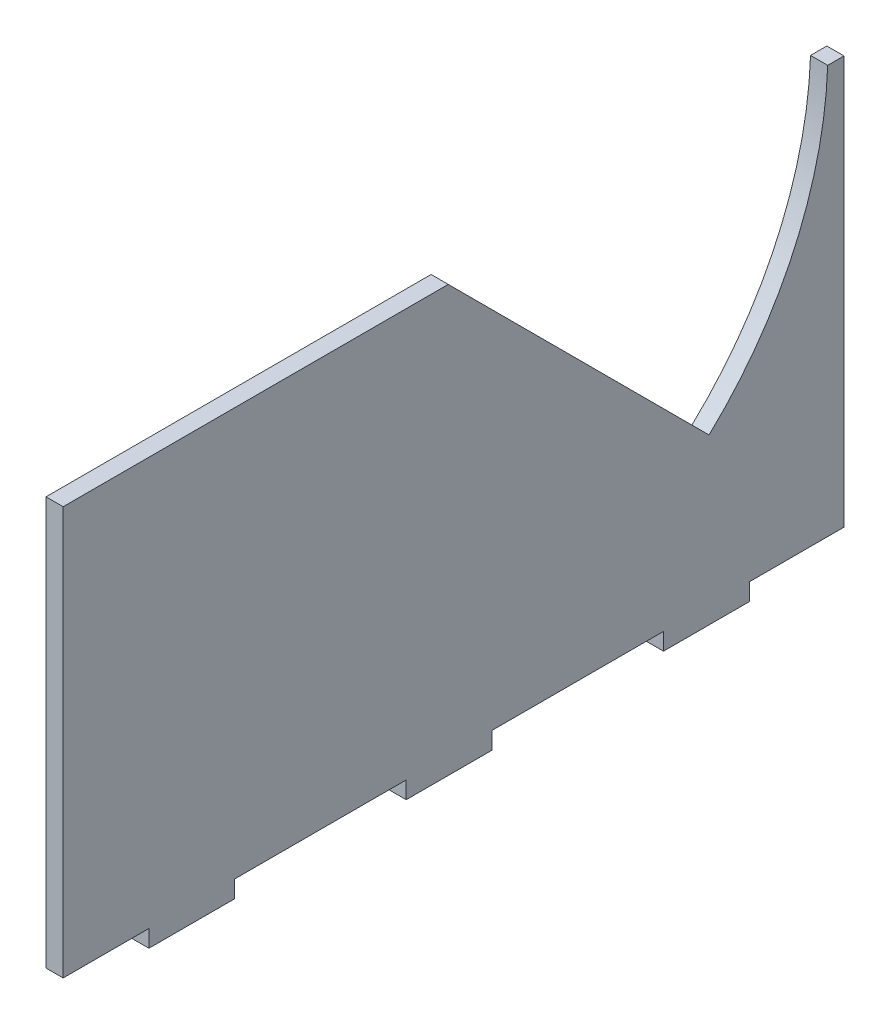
from build123d import *

# Parameters (mm, degrees)
BOSS_EXTRUDE1_DEPTH = 20


with BuildPart() as part:
    # Sketch1 → Boss-Extrude1 (new body)
    with BuildSketch(Plane(origin=(0, 0, 0), x_dir=(0, 0, -1), z_dir=(1, 0, 0))):
        with BuildLine():
            Line((0, 0), (100, 0))
            Line((100, 0), (100, -20))
            Line((100, -20), (200, -20))
            Line((200, -20), (200, 0))
            Line((200, 0), (400, 0))
            Line((400, 0), (400, -20))
            Line((400, -20), (500, -20))
            Line((500, -20), (500, 0))
            Line((500, 0), (700, 0))
            Line((700, 0), (700, -20))
            Line((700, -20), (800, -20))
            Line((800, -20), (800, 0))
            Line((800, 0), (910.465393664, 0))
            Line((910.465393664, 0), (910.465393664, 475.917508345))
            Line((910.465393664, 475.917508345), (891.465393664, 475.917508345))
            ThreePointArc((891.465393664, 475.917508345), (852.518905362, 310.120289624), (753.089193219, 171.847808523))
            Line((753.089193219, 171.847808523), (449.019493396, 475.917508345))
            Line((449.019493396, 475.917508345), (0, 475.917508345))
            Line((0, 475.917508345), (0, 0))
        make_face()
    extrude(amount=BOSS_EXTRUDE1_DEPTH)


solid = part.part
